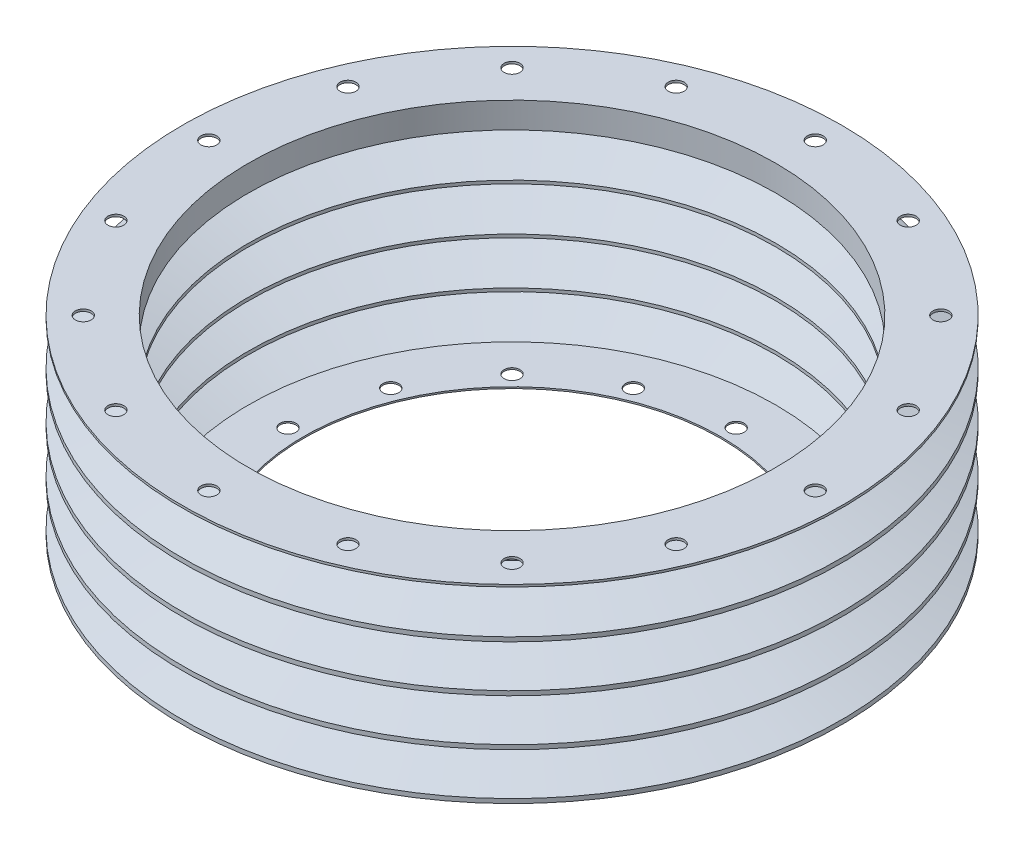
from build123d import *

# Parameters (mm, degrees)
F_7_2_7_2_DIAMETER_HOLE1_REACH  = 234.85
F_7_2_7_2_DIAMETER_HOLE1_BORE_R = 3.6
F_7_2_7_2_DIAMETER_HOLE2_D      = 7.2
CIRPATTERN1_COUNT               = 16


with BuildPart() as part:
    # Sketch1 → Revolve1 (revolve)
    with BuildSketch(Plane.XY, mode=Mode.PRIVATE) as revolve1_sk:
        Polygon((-121.016, 0), (-95, 0), (-95, 0.732937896), (-120, 0.732937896), (-149.759223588, 10.625), (-120, 20.517062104), (-120, 21.982937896), (-149.759223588, 31.875), (-120, 41.767062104), (-120, 43.232937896), (-149.759223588, 53.125), (-120, 63.017062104), (-120, 64.482937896), (-149.759223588, 74.375), (-120, 84.267062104), (-120, 96.016), (-150, 96.016), (-150, 95), (-121.016, 95), (-121.016, 85), (-150, 75.365624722), (-150, 73.384375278), (-121.016, 63.75), (-150, 54.115624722), (-150, 52.134375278), (-121.016, 42.5), (-150, 32.865624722), (-150, 30.884375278), (-121.016, 21.25), (-150, 11.615624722), (-150, 9.634375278), align=None)
    revolve(revolve1_sk.sketch.rotate(Axis((0, 0, 0), (0, 1, 0)), 270), axis=Axis((0, 0, 0), (0, 1, 0)))

    # 7.2 _7.2_ Diameter Hole1 bore → 7.2 _7.2_ Diameter Hole1 (cut, up to next)
    with BuildSketch(Plane(origin=(0, 96.016, 0), x_dir=(-1, 0, 0), z_dir=(0, 1, 0)), mode=Mode.PRIVATE) as f_7_2_7_2_diameter_hole1_sk1:
        with Locations((138, 0)):
            Circle(F_7_2_7_2_DIAMETER_HOLE1_BORE_R)
    f_7_2_7_2_diameter_hole1_tool1 = extrude(f_7_2_7_2_diameter_hole1_sk1.sketch, amount=-F_7_2_7_2_DIAMETER_HOLE1_REACH, mode=Mode.PRIVATE) & part.part
    f_7_2_7_2_diameter_hole1 = f_7_2_7_2_diameter_hole1_tool1.solids().sort_by_distance((-138, 96.016, 0))[0]
    add(f_7_2_7_2_diameter_hole1, mode=Mode.SUBTRACT)

    # 7.2 _7.2_ Diameter Hole2 (through all)
    with Locations(Plane.XZ):
        with Locations((0, -102)):
            f_7_2_7_2_diameter_hole2 = Hole(F_7_2_7_2_DIAMETER_HOLE2_D / 2)

    # CirPattern1: 7.2 _7.2_ Diameter Hole1, 7.2 _7.2_ Diameter Hole2 ×16 about axis
    cirpattern1_axis = Axis((0, 0, 0), (0, 1, 0))
    add([f_7_2_7_2_diameter_hole1.rotate(cirpattern1_axis, i * 360 / CIRPATTERN1_COUNT) for i in range(1, CIRPATTERN1_COUNT)], mode=Mode.SUBTRACT)
    add([f_7_2_7_2_diameter_hole2.rotate(cirpattern1_axis, i * 360 / CIRPATTERN1_COUNT) for i in range(1, CIRPATTERN1_COUNT)], mode=Mode.SUBTRACT)


solid = part.part
